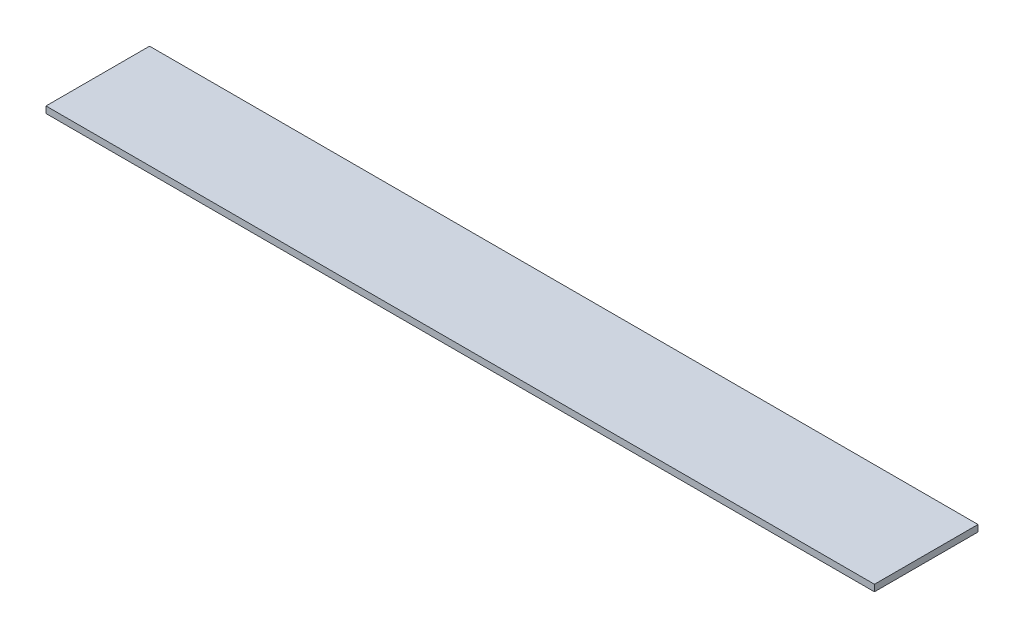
from build123d import *

# Parameters (mm, degrees)
SKETCH1_W           = 400
SKETCH1_H           = 50
BOSS_EXTRUDE1_DEPTH = 3.175


with BuildPart() as part:
    # Sketch1 → Boss-Extrude1 (new body)
    with BuildSketch(Plane(origin=(0, 0, 0), x_dir=(1, 0, 0), z_dir=(0, 1, 0))):
        with Locations((200, 25)):
            Rectangle(SKETCH1_W, SKETCH1_H)
    extrude(amount=BOSS_EXTRUDE1_DEPTH)


solid = part.part
